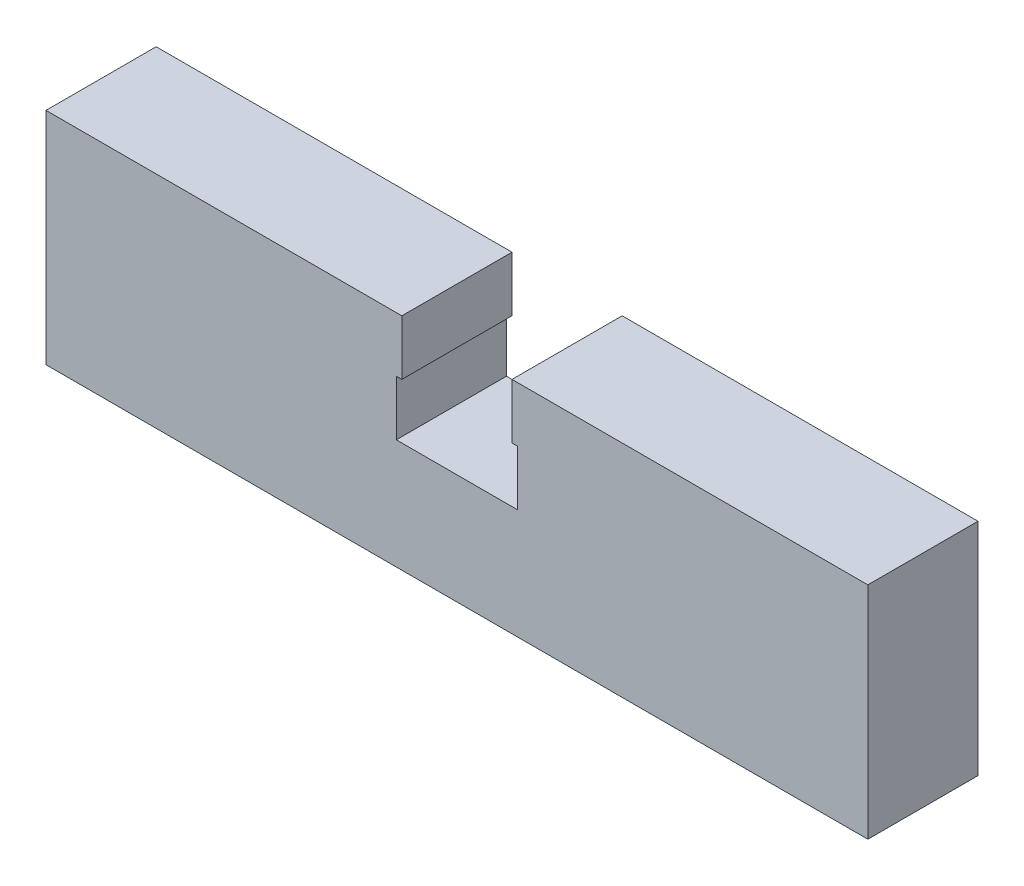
from build123d import *

# Parameters (mm, degrees)
SALIENTE_EXTRUIR1_DEPTH = 12.7
CROQUIS5_W              = 0.635
CROQUIS5_H              = 6.35
CORTAR_EXTRUIR2_DEPTH   = 51.661540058


with BuildPart() as part:
    # Croquis1 → Saliente-Extruir1 (new body)
    with BuildSketch(Plane.XY):
        Polygon((6.35, 12.7), (47.371, 12.7), (47.371, -12.7), (-47.371, -12.7), (-47.371, 12.7), (-6.35, 12.7), (-6.35, 0), (6.35, 0), align=None)
    extrude(amount=SALIENTE_EXTRUIR1_DEPTH)

    # Croquis5 → Cortar-Extruir2 (cut, through all)
    with BuildSketch(Plane.XY.offset(12.7)):
        with Locations((-6.6675, 3.175)):
            Rectangle(CROQUIS5_W, CROQUIS5_H)
        with Locations((6.6675, 3.175)):
            Rectangle(CROQUIS5_W, CROQUIS5_H)
    extrude(amount=-CORTAR_EXTRUIR2_DEPTH, mode=Mode.SUBTRACT)


solid = part.part
